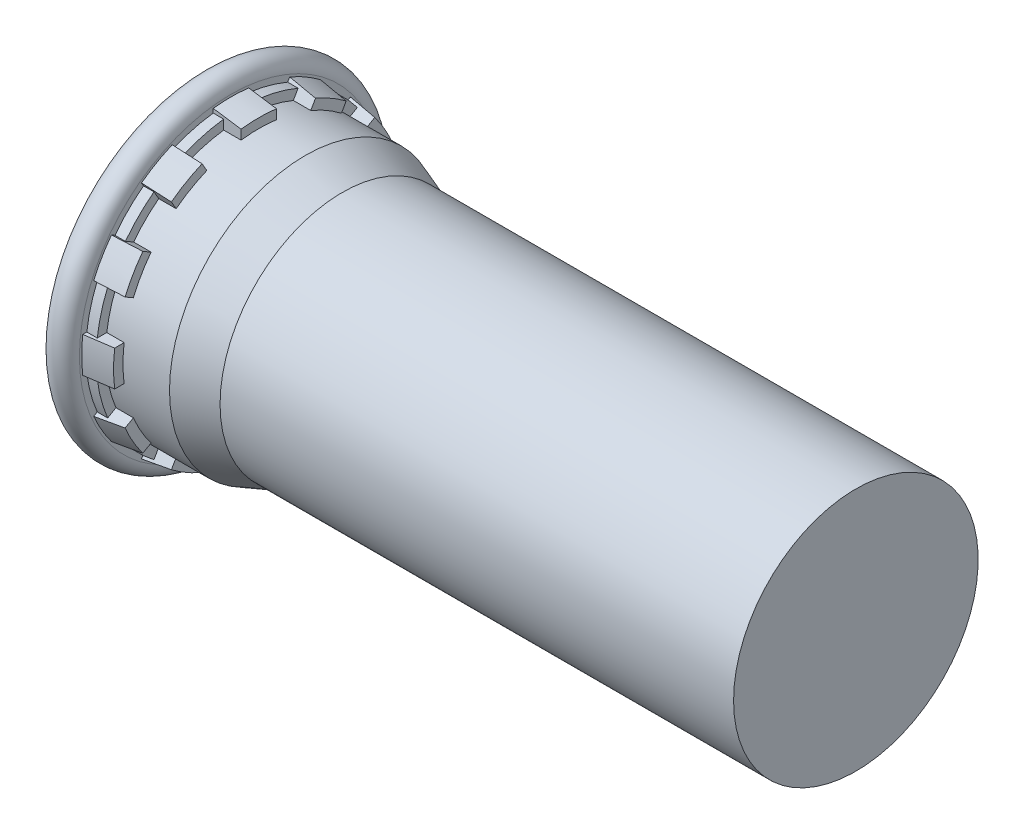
from build123d import *

# Parameters (mm, degrees)
RIBCUT1_DEPTH    = 0.508
RIBCUT2_DEPTH    = 0.8128
RIBCUTSPAT_COUNT = 12
RIBCUTSPAT_ANGLE = 330


with BuildPart() as part:
    # BodySke → BaseBody (revolve)
    with BuildSketch(Plane.XY, mode=Mode.PRIVATE) as basebody_sk:
        with BuildLine():
            Line((0, 0), (0, 4.41706))
            Line((0, 4.41706), (0.00508, 4.41706))
            Line((0.00508, 4.41706), (0.00508, 4.42214))
            ThreePointArc((0.00508, 4.42214), (0.40894, 4.826), (0.8128, 4.42214))
            Line((0.8128, 4.42214), (0.8128, 4.3561))
            Line((0.8128, 4.3561), (1.6256, 4.23799))
            Line((1.6256, 4.23799), (1.6256, 3.9624))
            Line((1.6256, 3.9624), (2.98231814, 3.9624))
            Line((2.98231814, 3.9624), (4.064, 3.5687))
            Line((4.064, 3.5687), (19.05, 3.5687))
            Line((19.05, 3.5687), (19.05, 0))
            Line((19.05, 0), (0, 0))
        make_face()
    revolve(basebody_sk.sketch.rotate(Axis((0, 0, 0), (1, 0, 0)), 90), axis=Axis((0, 0, 0), (1, 0, 0)))

    # RibCut1Ske → RibCut1 (cut)
    with BuildSketch(Plane(origin=(1.6256, 0, 0), x_dir=(0, 0, -1), z_dir=(1, 0, 0))):
        with BuildLine():
            Line((0.517196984, 3.928501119), (0.517196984, 4.798206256))
            ThreePointArc((0.517196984, 4.798206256), (1.249060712, 4.661558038), (1.951197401, 4.413967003))
            Line((1.951197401, 4.413967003), (1.516344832, 3.66078026))
            ThreePointArc((1.516344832, 3.66078026), (1.025544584, 3.827384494), (0.517196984, 3.928501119))
        make_face()
    ribcut1 = extrude(amount=-RIBCUT1_DEPTH, mode=Mode.SUBTRACT)

    # RibCut2Ske → RibCut2 (cut)
    with BuildSketch(Plane(origin=(1.6256, 0, 0), x_dir=(0, 0, -1), z_dir=(1, 0, 0))):
        with BuildLine():
            Line((0.517196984, 4.206312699), (0.517196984, 4.798206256))
            ThreePointArc((0.517196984, 4.798206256), (1.249060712, 4.661558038), (1.951197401, 4.413967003))
            Line((1.951197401, 4.413967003), (1.655250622, 3.901372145))
            ThreePointArc((1.655250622, 3.901372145), (1.096872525, 4.093583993), (0.517196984, 4.206312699))
        make_face()
    ribcut2 = extrude(amount=-RIBCUT2_DEPTH, mode=Mode.SUBTRACT)

    # RibCutsPat: RibCut1, RibCut2 ×12 about axis
    ribcutspat_axis = Axis((0, 0, 0), (1, 0, 0))
    add([ribcut1.rotate(ribcutspat_axis, i * RIBCUTSPAT_ANGLE / (RIBCUTSPAT_COUNT - 1)) for i in range(1, RIBCUTSPAT_COUNT)], mode=Mode.SUBTRACT)
    add([ribcut2.rotate(ribcutspat_axis, i * RIBCUTSPAT_ANGLE / (RIBCUTSPAT_COUNT - 1)) for i in range(1, RIBCUTSPAT_COUNT)], mode=Mode.SUBTRACT)


solid = part.part
